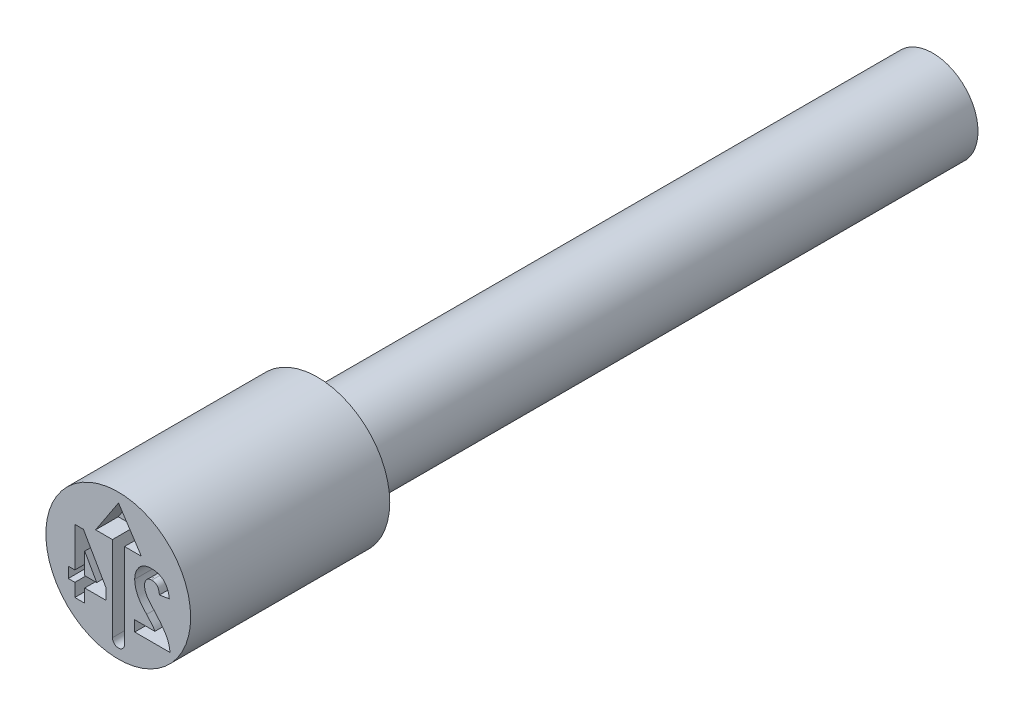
from build123d import *

# Parameters (mm, degrees)
CUT_EXTRUDE4_DEPTH = 0.25
CUT_EXTRUDE5_DEPTH = 0.25


with BuildPart() as part:
    # Sketch2 → Revolve1 (revolve)
    with BuildSketch(Plane(origin=(0, 0, 0), x_dir=(0, 0, -1), z_dir=(1, 0, 0)), mode=Mode.PRIVATE) as revolve1_sk:
        Polygon((0, 0.8), (0, 0), (9, 0), (9, 0.5), (2.2, 0.5), (2.2, 0.8), align=None)
    revolve(revolve1_sk.sketch.rotate(Axis((0, 0, -0.403888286), (0, 0, -1)), 90), axis=Axis((0, 0, -0.403888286), (0, 0, -1)))

    # Sketch3 → Cut-Extrude4 (cut)
    with BuildSketch(Plane.XY):
        with BuildLine():
            Line((0.069168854, 0.31237424), (0.069168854, -0.626505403))
            ThreePointArc((0.069168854, -0.626505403), (0.002503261, -0.693170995), (-0.064162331, -0.626505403))
            Line((-0.064162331, -0.626505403), (-0.064162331, 0.31237424))
            Line((-0.064162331, 0.31237424), (-0.250167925, 0.31237424))
            Line((-0.250167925, 0.31237424), (0.002503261, 0.69589161))
            Line((0.002503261, 0.69589161), (0.255174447, 0.31237424))
            Line((0.255174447, 0.31237424), (0.069168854, 0.31237424))
        make_face()
    extrude(amount=-CUT_EXTRUDE4_DEPTH, mode=Mode.SUBTRACT)

    # Sketch4 → Cut-Extrude5 (cut)
    # profile 1 of 2: a face of its own
    with BuildSketch(Plane.XY):
        with BuildLine():
            Line((0.181678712, -0.331818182), (0.181678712, -0.45))
            Line((0.181678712, -0.45), (0.572587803, -0.45))
            add(Edge.make_bspline(
                [(0.572587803, -0.45), (0.571212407, -0.438360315), (0.568465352, -0.415112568), (0.560147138, -0.380991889), (0.548934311, -0.347659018), (0.536656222, -0.32051693), (0.524471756, -0.298601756), (0.513571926, -0.280720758), (0.500591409, -0.261693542), (0.485545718, -0.241545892), (0.468862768, -0.219979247), (0.450173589, -0.197219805), (0.429575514, -0.173247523), (0.415040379, -0.156982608), (0.407530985, -0.148579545)],
                knots=[0, 0, 0, 0, 1.20268352, 2.402099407, 3.598367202, 4.810420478, 5.454599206, 6.172593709, 6.960183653, 7.818888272, 8.754527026, 9.759992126, 10.842728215, 12, 12, 12, 12], degree=3))
            add(Edge.make_bspline(
                [(0.407530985, -0.148579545), (0.401643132, -0.142012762), (0.390379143, -0.129449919), (0.374535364, -0.111257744), (0.360283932, -0.094898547), (0.348079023, -0.08003461), (0.337490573, -0.066976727), (0.328715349, -0.055525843), (0.321648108, -0.045781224), (0.317870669, -0.039650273), (0.316195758, -0.036931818)],
                knots=[0, 0, 0, 0, 1.465870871, 2.804341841, 4.009590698, 5.071600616, 6.000740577, 6.80347298, 7.469461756, 8, 8, 8, 8], degree=3))
            add(Edge.make_bspline(
                [(0.316195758, -0.036931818), (0.312308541, -0.029968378), (0.30472061, -0.016375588), (0.296818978, 0.005164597), (0.291654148, 0.026743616), (0.291062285, 0.041259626), (0.290769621, 0.0484375)],
                knots=[0, 0, 0, 0, 1.060288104, 2.069705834, 3.04550853, 4, 4, 4, 4], degree=3))
            add(Edge.make_bspline(
                [(0.290769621, 0.0484375), (0.291020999, 0.055609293), (0.291496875, 0.069185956), (0.295569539, 0.088154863), (0.30237804, 0.104467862), (0.312219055, 0.117712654), (0.324199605, 0.128109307), (0.338018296, 0.135695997), (0.353657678, 0.140190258), (0.364651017, 0.140664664), (0.370315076, 0.140909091)],
                knots=[0, 0, 0, 0, 1.245810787, 2.358399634, 3.353971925, 4.295778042, 5.200327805, 6.09189762, 7.016895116, 8, 8, 8, 8], degree=3))
            add(Edge.make_bspline(
                [(0.370315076, 0.140909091), (0.376457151, 0.140640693), (0.388229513, 0.140126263), (0.404786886, 0.135336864), (0.419157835, 0.127441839), (0.430934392, 0.115983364), (0.440599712, 0.101667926), (0.447577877, 0.08407103), (0.452362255, 0.063526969), (0.453697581, 0.048748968), (0.454405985, 0.040909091)],
                knots=[0, 0, 0, 0, 0.999920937, 1.916523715, 2.784458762, 3.647604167, 4.570853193, 5.582015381, 6.717234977, 8, 8, 8, 8], degree=3))
            Line((0.454405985, 0.040909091), (0.563496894, 0.059090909))
            add(Edge.make_bspline(
                [(0.563496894, 0.059090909), (0.562583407, 0.067065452), (0.560811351, 0.082535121), (0.556119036, 0.104755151), (0.550561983, 0.125408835), (0.543603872, 0.144389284), (0.535352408, 0.161721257), (0.525779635, 0.177385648), (0.51516156, 0.19164604), (0.502962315, 0.204020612), (0.489668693, 0.214846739), (0.475370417, 0.224322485), (0.459962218, 0.232245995), (0.443578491, 0.23885332), (0.426070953, 0.243745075), (0.40761771, 0.247489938), (0.388072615, 0.249602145), (0.374723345, 0.24986543), (0.367900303, 0.25)],
                knots=[0, 0, 0, 0, 1.257113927, 2.438652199, 3.554660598, 4.606291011, 5.601856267, 6.557471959, 7.478981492, 8.381416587, 9.2725261, 10.161501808, 11.064119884, 11.98308707, 12.924775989, 13.908409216, 14.930951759, 16, 16, 16, 16], degree=3))
            add(Edge.make_bspline(
                [(0.367900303, 0.25), (0.360407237, 0.249879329), (0.345883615, 0.249645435), (0.324844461, 0.246610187), (0.305145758, 0.242285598), (0.28698133, 0.235558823), (0.270033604, 0.227467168), (0.254793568, 0.216991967), (0.240636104, 0.205119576), (0.228497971, 0.19102481), (0.217448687, 0.176126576), (0.207961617, 0.160424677), (0.199747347, 0.144335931), (0.193201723, 0.127572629), (0.188105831, 0.110264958), (0.184433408, 0.092449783), (0.182027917, 0.074118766), (0.181796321, 0.061702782), (0.181678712, 0.055397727)],
                knots=[0, 0, 0, 0, 1.185802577, 2.298411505, 3.360827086, 4.373838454, 5.359924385, 6.327149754, 7.295159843, 8.277960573, 9.264958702, 10.230903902, 11.180079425, 12.122922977, 13.076886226, 14.034409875, 15.001838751, 16, 16, 16, 16], degree=3))
            add(Edge.make_bspline(
                [(0.181678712, 0.055397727), (0.181798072, 0.048241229), (0.182035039, 0.03403341), (0.184468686, 0.012876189), (0.18806308, -0.007986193), (0.193395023, -0.028581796), (0.200289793, -0.049015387), (0.208685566, -0.06946387), (0.218633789, -0.089994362), (0.22843001, -0.107005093), (0.237207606, -0.121137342), (0.245023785, -0.132433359), (0.25393149, -0.144389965), (0.26368098, -0.157208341), (0.274654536, -0.170641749), (0.286584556, -0.184850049), (0.299512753, -0.199766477), (0.308557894, -0.209861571), (0.313212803, -0.215056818)],
                knots=[0, 0, 0, 0, 1.112568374, 2.208785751, 3.308090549, 4.402946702, 5.513734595, 6.659701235, 7.83876403, 9.059051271, 9.71083511, 10.425746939, 11.194567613, 12.029688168, 12.930202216, 13.891926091, 14.915120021, 16, 16, 16, 16], degree=3))
            add(Edge.make_bspline(
                [(0.313212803, -0.215056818), (0.317523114, -0.219837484), (0.325740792, -0.228951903), (0.337461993, -0.242003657), (0.347723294, -0.253976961), (0.357023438, -0.264436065), (0.364956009, -0.273688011), (0.371723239, -0.281617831), (0.377023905, -0.288458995), (0.385052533, -0.298453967), (0.394694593, -0.312522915), (0.401538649, -0.325549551), (0.404832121, -0.331818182)],
                knots=[0, 0, 0, 0, 1.297038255, 2.472825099, 3.534584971, 4.474279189, 5.292832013, 5.990344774, 6.574432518, 7.036342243, 8.573839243, 10, 10, 10, 10], degree=3))
            Line((0.404832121, -0.331818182), (0.181678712, -0.331818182))
        make_face()
    # profile 2 of 2: a face of its own
    with BuildSketch(Plane.XY):
        Polygon((-0.370684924, -0.45), (-0.370684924, -0.304545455), (-0.134321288, -0.304545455), (-0.134321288, -0.186789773), (-0.38488947, 0.25), (-0.479775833, 0.25), (-0.479775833, -0.186363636), (-0.552503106, -0.186363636), (-0.552503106, -0.304545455), (-0.479775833, -0.304545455), (-0.479775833, -0.45), align=None)
        Polygon((-0.370684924, -0.186363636), (-0.370684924, 0.048721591), (-0.238156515, -0.186363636), align=None, mode=Mode.SUBTRACT)
    extrude(amount=-CUT_EXTRUDE5_DEPTH, mode=Mode.SUBTRACT)


solid = part.part
